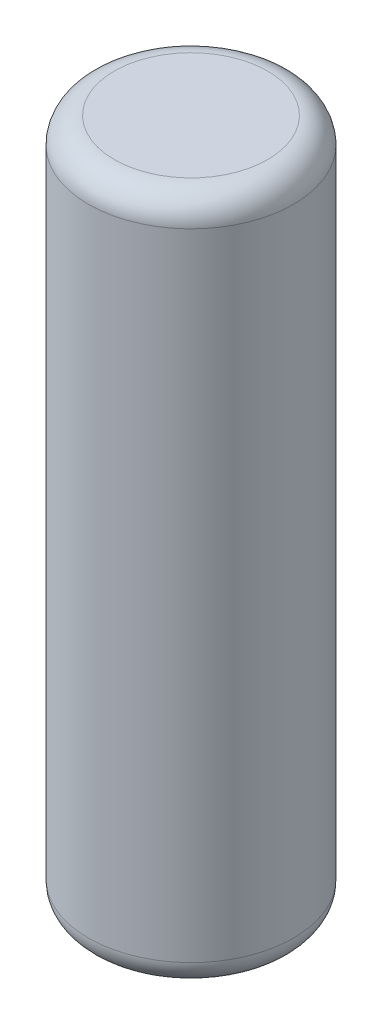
ISO-10303-21;
HEADER;
FILE_DESCRIPTION(('STEP AP214'),'2;1');
FILE_NAME('part.step','',(''),(''),'','','');
FILE_SCHEMA(('AUTOMOTIVE_DESIGN { 1 0 10303 214 1 1 1 1 }'));
ENDSEC;
DATA;
#1=APPLICATION_CONTEXT('core data for automotive mechanical design processes');
#2=APPLICATION_PROTOCOL_DEFINITION('international standard','automotive_design',2000,#1);
#3=PRODUCT_CONTEXT('',#1,'mechanical');
#4=PRODUCT('Part','Part','',(#3));
#5=PRODUCT_RELATED_PRODUCT_CATEGORY('part','',(#4));
#6=PRODUCT_DEFINITION_FORMATION('','',#4);
#7=PRODUCT_DEFINITION_CONTEXT('part definition',#1,'design');
#8=PRODUCT_DEFINITION('design','',#6,#7);
#9=PRODUCT_DEFINITION_SHAPE('','',#8);
#10=(LENGTH_UNIT() NAMED_UNIT(*) SI_UNIT(.MILLI.,.METRE.));
#11=(NAMED_UNIT(*) PLANE_ANGLE_UNIT() SI_UNIT($,.RADIAN.));
#12=(NAMED_UNIT(*) SI_UNIT($,.STERADIAN.) SOLID_ANGLE_UNIT());
#13=UNCERTAINTY_MEASURE_WITH_UNIT(LENGTH_MEASURE(1.E-05),#10,'distance_accuracy_value','');
#14=(GEOMETRIC_REPRESENTATION_CONTEXT(3) GLOBAL_UNCERTAINTY_ASSIGNED_CONTEXT((#13)) GLOBAL_UNIT_ASSIGNED_CONTEXT((#10,
#11,#12)) REPRESENTATION_CONTEXT('',''));
#15=CARTESIAN_POINT('',(0.,0.,0.));
#16=DIRECTION('',(0.,0.,1.));
#17=DIRECTION('',(1.,0.,0.));
#18=AXIS2_PLACEMENT_3D('',#15,#16,#17);
#19=CARTESIAN_POINT('',(0.,0.3,0.));
#20=DIRECTION('',(0.,1.,0.));
#21=DIRECTION('',(0.,0.,1.));
#22=AXIS2_PLACEMENT_3D('',#19,#20,#21);
#23=TOROIDAL_SURFACE('',#22,0.89,0.3);
#24=CARTESIAN_POINT('',(0.,0.3,0.));
#25=DIRECTION('',(0.,1.,0.));
#26=DIRECTION('',(0.,0.,1.));
#27=AXIS2_PLACEMENT_3D('',#24,#25,#26);
#28=CIRCLE('',#27,1.19);
#29=CARTESIAN_POINT('',(0.,0.3,1.19));
#30=VERTEX_POINT('',#29);
#31=EDGE_CURVE('E39',#30,#30,#28,.T.);
#32=ORIENTED_EDGE('',*,*,#31,.F.);
#33=EDGE_LOOP('',(#32));
#34=FACE_BOUND('',#33,.T.);
#35=CARTESIAN_POINT('',(0.,0.,0.));
#36=DIRECTION('',(0.,1.,0.));
#37=DIRECTION('',(0.,0.,1.));
#38=AXIS2_PLACEMENT_3D('',#35,#36,#37);
#39=CIRCLE('',#38,0.89);
#40=CARTESIAN_POINT('',(0.,0.,0.89));
#41=VERTEX_POINT('',#40);
#42=EDGE_CURVE('E10',#41,#41,#39,.F.);
#43=ORIENTED_EDGE('',*,*,#42,.F.);
#44=EDGE_LOOP('',(#43));
#45=FACE_BOUND('',#44,.T.);
#46=ADVANCED_FACE('F33',(#34,#45),#23,.T.);
#47=CARTESIAN_POINT('',(0.,7.6735,0.));
#48=DIRECTION('',(0.,1.,0.));
#49=DIRECTION('',(0.,0.,1.));
#50=AXIS2_PLACEMENT_3D('',#47,#48,#49);
#51=TOROIDAL_SURFACE('',#50,0.89,0.3);
#52=CARTESIAN_POINT('',(0.,7.9735,0.));
#53=DIRECTION('',(0.,1.,0.));
#54=DIRECTION('',(0.,0.,1.));
#55=AXIS2_PLACEMENT_3D('',#52,#53,#54);
#56=CIRCLE('',#55,0.89);
#57=CARTESIAN_POINT('',(0.,7.9735,0.89));
#58=VERTEX_POINT('',#57);
#59=EDGE_CURVE('E47',#58,#58,#56,.T.);
#60=ORIENTED_EDGE('',*,*,#59,.F.);
#61=EDGE_LOOP('',(#60));
#62=FACE_BOUND('',#61,.T.);
#63=CARTESIAN_POINT('',(0.,7.6735,0.));
#64=DIRECTION('',(0.,1.,0.));
#65=DIRECTION('',(0.,0.,1.));
#66=AXIS2_PLACEMENT_3D('',#63,#64,#65);
#67=CIRCLE('',#66,1.19);
#68=CARTESIAN_POINT('',(0.,7.6735,1.19));
#69=VERTEX_POINT('',#68);
#70=EDGE_CURVE('E43',#69,#69,#67,.F.);
#71=ORIENTED_EDGE('',*,*,#70,.F.);
#72=EDGE_LOOP('',(#71));
#73=FACE_BOUND('',#72,.T.);
#74=ADVANCED_FACE('F55',(#62,#73),#51,.T.);
#75=CARTESIAN_POINT('',(0.,7.9735,0.));
#76=DIRECTION('',(0.,-1.,0.));
#77=DIRECTION('',(0.,0.,-1.));
#78=AXIS2_PLACEMENT_3D('',#75,#76,#77);
#79=CYLINDRICAL_SURFACE('',#78,1.19);
#80=ORIENTED_EDGE('',*,*,#31,.T.);
#81=EDGE_LOOP('',(#80));
#82=FACE_BOUND('',#81,.T.);
#83=ORIENTED_EDGE('',*,*,#70,.T.);
#84=EDGE_LOOP('',(#83));
#85=FACE_BOUND('',#84,.T.);
#86=ADVANCED_FACE('F58',(#82,#85),#79,.T.);
#87=CARTESIAN_POINT('',(0.,7.9735,0.));
#88=DIRECTION('',(0.,1.,0.));
#89=DIRECTION('',(0.,0.,1.));
#90=AXIS2_PLACEMENT_3D('',#87,#88,#89);
#91=PLANE('',#90);
#92=ORIENTED_EDGE('',*,*,#59,.T.);
#93=EDGE_LOOP('',(#92));
#94=FACE_BOUND('',#93,.T.);
#95=ADVANCED_FACE('F53',(#94),#91,.T.);
#96=CARTESIAN_POINT('',(0.,0.,0.));
#97=DIRECTION('',(0.,1.,0.));
#98=DIRECTION('',(0.,0.,1.));
#99=AXIS2_PLACEMENT_3D('',#96,#97,#98);
#100=PLANE('',#99);
#101=ORIENTED_EDGE('',*,*,#42,.T.);
#102=EDGE_LOOP('',(#101));
#103=FACE_BOUND('',#102,.T.);
#104=ADVANCED_FACE('F66',(#103),#100,.F.);
#105=CLOSED_SHELL('',(#46,#74,#86,#95,#104));
#106=MANIFOLD_SOLID_BREP('B2',#105);
#107=ADVANCED_BREP_SHAPE_REPRESENTATION('',(#18,#106),#14);
#108=SHAPE_DEFINITION_REPRESENTATION(#9,#107);
ENDSEC;
END-ISO-10303-21;
